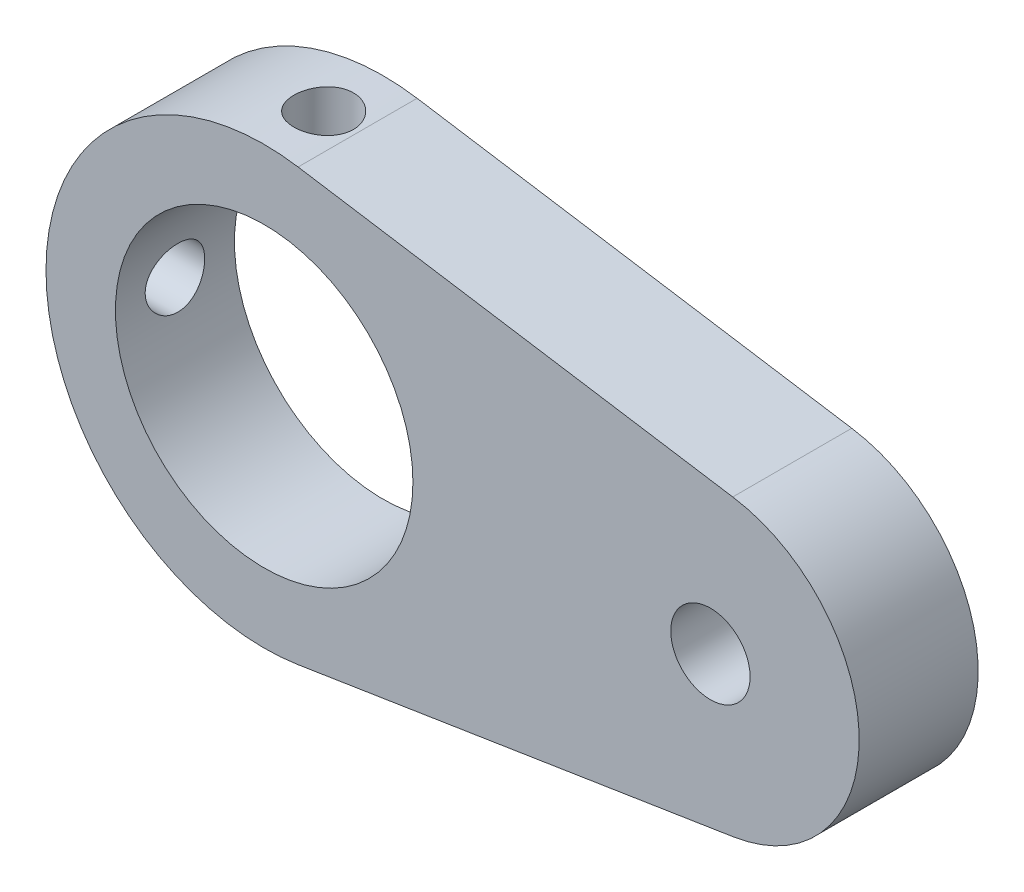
from build123d import *

# Parameters (mm, degrees)
SKETCH_1_R          = 15
SKETCH_1_R_2        = 4
EXTRUDE_1_DEPTH     = 12
SKETCH_2_R          = 3
CUT_EXTRUDE_1_DEPTH = 10
SKETCH_3_R          = 3
CUT_EXTRUDE_2_DEPTH = 13


with BuildPart() as part:
    # Sketch 1 → Extrude 1 (new body)
    with BuildSketch(Plane.XY):
        with BuildLine():
            Line((47.250338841, -14.830238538), (3.422337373, -21.732179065))
            ThreePointArc((3.422337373, -21.732179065), (-22, 0), (3.422337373, 21.732179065))
            Line((3.422337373, 21.732179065), (47.250338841, 14.830238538))
            ThreePointArc((47.250338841, 14.830238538), (60, 0), (47.250338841, -14.830238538))
        make_face()
        Circle(SKETCH_1_R, mode=Mode.SUBTRACT)
        with Locations((45, 0)):
            Circle(SKETCH_1_R_2, mode=Mode.SUBTRACT)
    extrude(amount=EXTRUDE_1_DEPTH)

    # Sketch 2 → Cut-Extrude 1 (cut)
    with BuildSketch(Plane(origin=(0, 22, 0), x_dir=(1, 0, 0), z_dir=(0, 1, 0))):
        with Locations(Location((0, -6, 0), (0, 0, 270))):
            Circle(SKETCH_2_R)
    extrude(amount=-CUT_EXTRUDE_1_DEPTH, mode=Mode.SUBTRACT)

    # Sketch 3 → Cut-Extrude 2 (cut)
    with BuildSketch(Plane(origin=(-22, 0, 0), x_dir=(0, 0, -1), z_dir=(1, 0, 0))):
        with Locations(Location((-6, 0, 0), (0, 0, 180))):
            Circle(SKETCH_3_R)
    extrude(amount=CUT_EXTRUDE_2_DEPTH, mode=Mode.SUBTRACT)


solid = part.part
